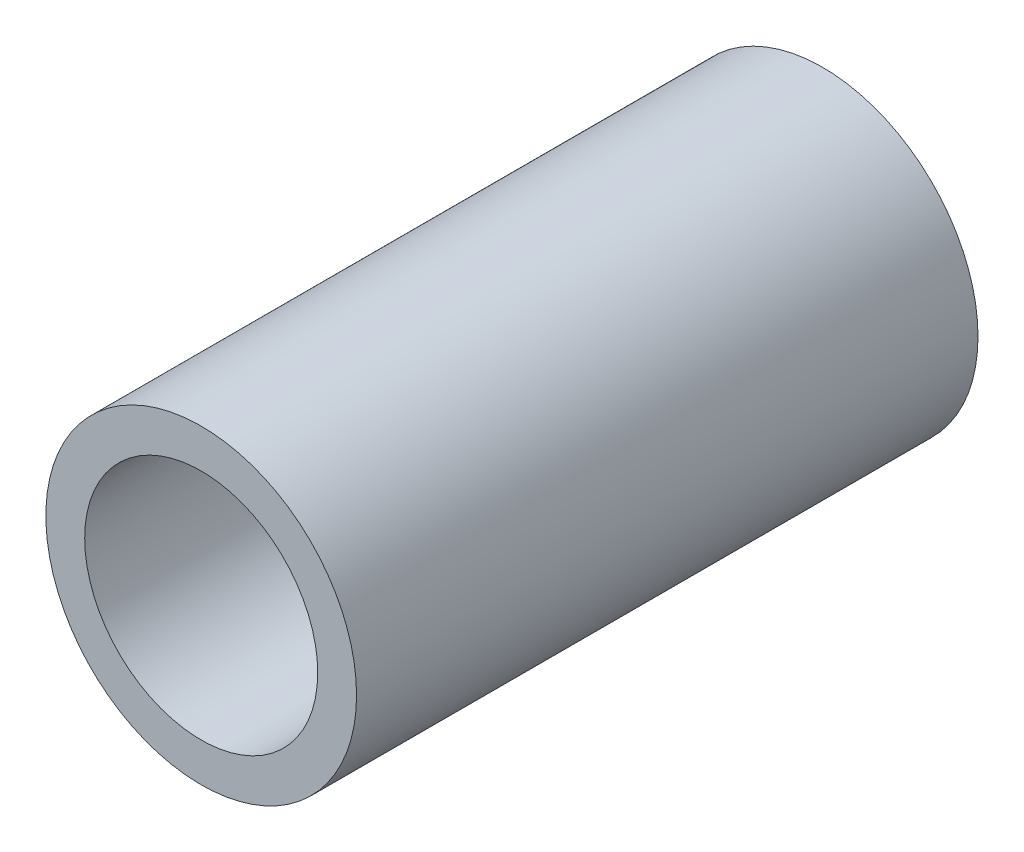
from build123d import *

# Parameters (mm, degrees)
ESQUISSE1_R      = 2
ESQUISSE1_R_2    = 1.5
EXTRUSION1_DEPTH = 4


with BuildPart() as part:
    # Esquisse1 → Extrusion1 (new, symmetric)
    with BuildSketch(Plane.XY):
        Circle(ESQUISSE1_R)
        Circle(ESQUISSE1_R_2, mode=Mode.SUBTRACT)
    extrude(amount=EXTRUSION1_DEPTH, both=True)


solid = part.part
